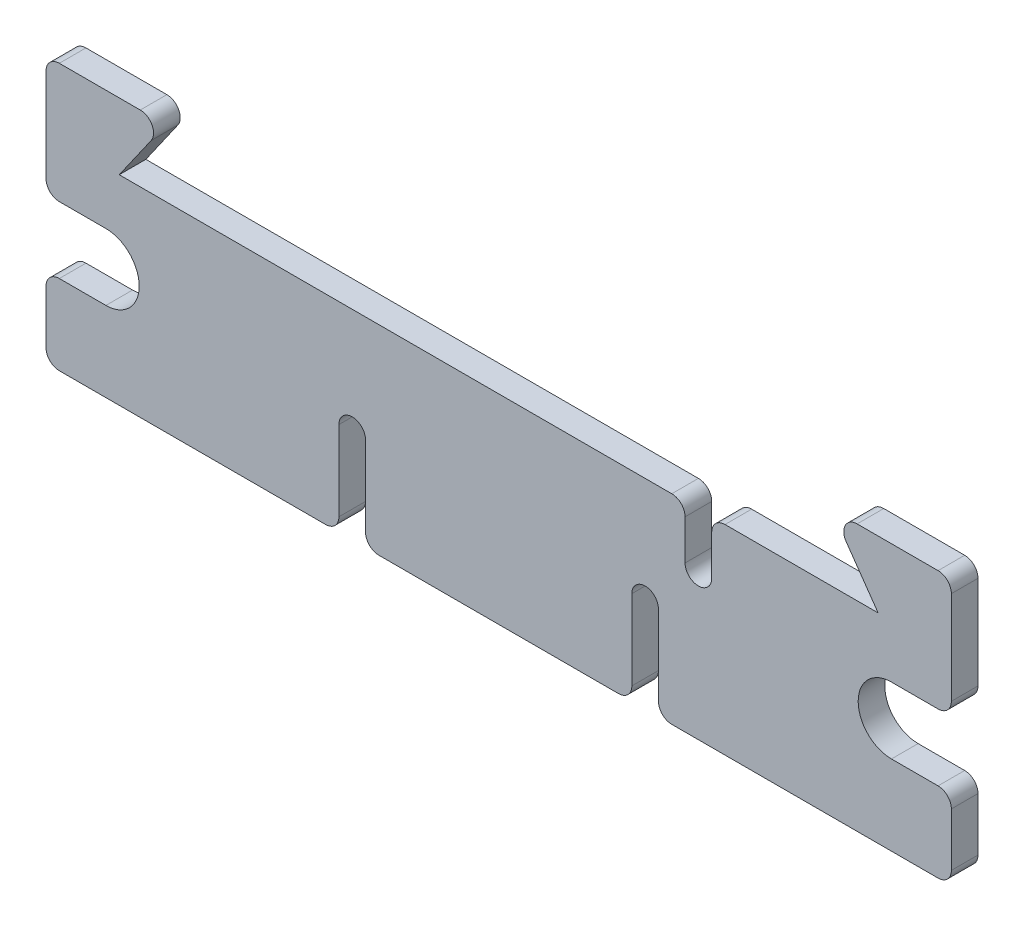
ISO-10303-21;
HEADER;
FILE_DESCRIPTION(('STEP AP214'),'2;1');
FILE_NAME('part.step','',(''),(''),'','','');
FILE_SCHEMA(('AUTOMOTIVE_DESIGN { 1 0 10303 214 1 1 1 1 }'));
ENDSEC;
DATA;
#1=APPLICATION_CONTEXT('core data for automotive mechanical design processes');
#2=APPLICATION_PROTOCOL_DEFINITION('international standard','automotive_design',2000,#1);
#3=PRODUCT_CONTEXT('',#1,'mechanical');
#4=PRODUCT('Part','Part','',(#3));
#5=PRODUCT_RELATED_PRODUCT_CATEGORY('part','',(#4));
#6=PRODUCT_DEFINITION_FORMATION('','',#4);
#7=PRODUCT_DEFINITION_CONTEXT('part definition',#1,'design');
#8=PRODUCT_DEFINITION('design','',#6,#7);
#9=PRODUCT_DEFINITION_SHAPE('','',#8);
#10=(LENGTH_UNIT() NAMED_UNIT(*) SI_UNIT(.MILLI.,.METRE.));
#11=(NAMED_UNIT(*) PLANE_ANGLE_UNIT() SI_UNIT($,.RADIAN.));
#12=(NAMED_UNIT(*) SI_UNIT($,.STERADIAN.) SOLID_ANGLE_UNIT());
#13=UNCERTAINTY_MEASURE_WITH_UNIT(LENGTH_MEASURE(1.E-05),#10,'distance_accuracy_value','');
#14=(GEOMETRIC_REPRESENTATION_CONTEXT(3) GLOBAL_UNCERTAINTY_ASSIGNED_CONTEXT((#13)) GLOBAL_UNIT_ASSIGNED_CONTEXT((#10,
#11,#12)) REPRESENTATION_CONTEXT('',''));
#15=CARTESIAN_POINT('',(0.,0.,0.));
#16=DIRECTION('',(0.,0.,1.));
#17=DIRECTION('',(1.,0.,0.));
#18=AXIS2_PLACEMENT_3D('',#15,#16,#17);
#19=CARTESIAN_POINT('',(17.,0.,2.));
#20=DIRECTION('',(0.,-1.,0.));
#21=DIRECTION('',(1.,0.,0.));
#22=AXIS2_PLACEMENT_3D('',#19,#20,#21);
#23=PLANE('',#22);
#24=DIRECTION('',(-1.,0.,0.));
#25=VECTOR('',#24,1.);
#26=CARTESIAN_POINT('',(17.,0.,0.));
#27=LINE('',#26,#25);
#28=CARTESIAN_POINT('',(28.5,0.,0.));
#29=VERTEX_POINT('',#28);
#30=CARTESIAN_POINT('',(17.,0.,0.));
#31=VERTEX_POINT('',#30);
#32=EDGE_CURVE('E344',#29,#31,#27,.T.);
#33=ORIENTED_EDGE('',*,*,#32,.T.);
#34=DIRECTION('',(0.,0.,-1.));
#35=VECTOR('',#34,1.);
#36=CARTESIAN_POINT('',(17.,0.,2.));
#37=LINE('',#36,#35);
#38=CARTESIAN_POINT('',(17.,0.,2.));
#39=VERTEX_POINT('',#38);
#40=EDGE_CURVE('E11',#39,#31,#37,.T.);
#41=ORIENTED_EDGE('',*,*,#40,.F.);
#42=DIRECTION('',(-1.,0.,0.));
#43=VECTOR('',#42,1.);
#44=CARTESIAN_POINT('',(17.,0.,2.));
#45=LINE('',#44,#43);
#46=CARTESIAN_POINT('',(28.5,0.,2.));
#47=VERTEX_POINT('',#46);
#48=EDGE_CURVE('E430',#47,#39,#45,.T.);
#49=ORIENTED_EDGE('',*,*,#48,.F.);
#50=DIRECTION('',(0.,0.,-1.));
#51=VECTOR('',#50,1.);
#52=CARTESIAN_POINT('',(28.5,0.,2.));
#53=LINE('',#52,#51);
#54=EDGE_CURVE('E340',#47,#29,#53,.T.);
#55=ORIENTED_EDGE('',*,*,#54,.T.);
#56=EDGE_LOOP('',(#33,#41,#49,#55));
#57=FACE_BOUND('',#56,.T.);
#58=ADVANCED_FACE('F32',(#57),#23,.F.);
#59=CARTESIAN_POINT('',(17.,-1.,2.));
#60=DIRECTION('',(0.,0.,-1.));
#61=DIRECTION('',(-1.,0.,0.));
#62=AXIS2_PLACEMENT_3D('',#59,#60,#61);
#63=CYLINDRICAL_SURFACE('',#62,1.);
#64=CARTESIAN_POINT('',(17.,-1.,0.));
#65=DIRECTION('',(0.,0.,1.));
#66=DIRECTION('',(-1.,0.,0.));
#67=AXIS2_PLACEMENT_3D('',#64,#65,#66);
#68=CIRCLE('',#67,1.);
#69=CARTESIAN_POINT('',(16.,-1.00000000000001,0.));
#70=VERTEX_POINT('',#69);
#71=EDGE_CURVE('E347',#31,#70,#68,.T.);
#72=ORIENTED_EDGE('',*,*,#71,.T.);
#73=DIRECTION('',(0.,0.,-1.));
#74=VECTOR('',#73,1.);
#75=CARTESIAN_POINT('',(16.,-1.00000000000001,2.));
#76=LINE('',#75,#74);
#77=CARTESIAN_POINT('',(16.,-1.00000000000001,2.));
#78=VERTEX_POINT('',#77);
#79=EDGE_CURVE('E40',#78,#70,#76,.T.);
#80=ORIENTED_EDGE('',*,*,#79,.F.);
#81=CARTESIAN_POINT('',(17.,-1.,2.));
#82=DIRECTION('',(0.,0.,1.));
#83=DIRECTION('',(-1.,0.,0.));
#84=AXIS2_PLACEMENT_3D('',#81,#82,#83);
#85=CIRCLE('',#84,1.);
#86=EDGE_CURVE('E199',#39,#78,#85,.T.);
#87=ORIENTED_EDGE('',*,*,#86,.F.);
#88=ORIENTED_EDGE('',*,*,#40,.T.);
#89=EDGE_LOOP('',(#72,#80,#87,#88));
#90=FACE_BOUND('',#89,.T.);
#91=ADVANCED_FACE('F668',(#90),#63,.T.);
#92=CARTESIAN_POINT('',(16.,-1.00000000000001,2.));
#93=DIRECTION('',(1.,0.,0.));
#94=DIRECTION('',(0.,0.,-1.));
#95=AXIS2_PLACEMENT_3D('',#92,#93,#94);
#96=PLANE('',#95);
#97=DIRECTION('',(0.,-1.,0.));
#98=VECTOR('',#97,1.);
#99=CARTESIAN_POINT('',(16.,-1.00000000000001,0.));
#100=LINE('',#99,#98);
#101=CARTESIAN_POINT('',(16.,-4.,0.));
#102=VERTEX_POINT('',#101);
#103=EDGE_CURVE('E349',#70,#102,#100,.T.);
#104=ORIENTED_EDGE('',*,*,#103,.T.);
#105=DIRECTION('',(0.,0.,-1.));
#106=VECTOR('',#105,1.);
#107=CARTESIAN_POINT('',(16.,-4.,2.));
#108=LINE('',#107,#106);
#109=CARTESIAN_POINT('',(16.,-4.,2.));
#110=VERTEX_POINT('',#109);
#111=EDGE_CURVE('E545',#110,#102,#108,.T.);
#112=ORIENTED_EDGE('',*,*,#111,.F.);
#113=DIRECTION('',(0.,-1.,0.));
#114=VECTOR('',#113,1.);
#115=CARTESIAN_POINT('',(16.,-1.00000000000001,2.));
#116=LINE('',#115,#114);
#117=EDGE_CURVE('E553',#78,#110,#116,.T.);
#118=ORIENTED_EDGE('',*,*,#117,.F.);
#119=ORIENTED_EDGE('',*,*,#79,.T.);
#120=EDGE_LOOP('',(#104,#112,#118,#119));
#121=FACE_BOUND('',#120,.T.);
#122=ADVANCED_FACE('F551',(#121),#96,.F.);
#123=CARTESIAN_POINT('',(15.,-4.,2.));
#124=DIRECTION('',(0.,0.,-1.));
#125=DIRECTION('',(-1.,0.,0.));
#126=AXIS2_PLACEMENT_3D('',#123,#124,#125);
#127=CYLINDRICAL_SURFACE('',#126,0.999999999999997);
#128=CARTESIAN_POINT('',(15.,-4.,0.));
#129=DIRECTION('',(0.,0.,-1.));
#130=DIRECTION('',(1.,0.,0.));
#131=AXIS2_PLACEMENT_3D('',#128,#129,#130);
#132=CIRCLE('',#131,0.999999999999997);
#133=CARTESIAN_POINT('',(14.,-4.,0.));
#134=VERTEX_POINT('',#133);
#135=EDGE_CURVE('E351',#102,#134,#132,.T.);
#136=ORIENTED_EDGE('',*,*,#135,.T.);
#137=DIRECTION('',(0.,0.,-1.));
#138=VECTOR('',#137,1.);
#139=CARTESIAN_POINT('',(14.,-4.,2.));
#140=LINE('',#139,#138);
#141=CARTESIAN_POINT('',(14.,-4.,2.));
#142=VERTEX_POINT('',#141);
#143=EDGE_CURVE('E542',#142,#134,#140,.T.);
#144=ORIENTED_EDGE('',*,*,#143,.F.);
#145=CARTESIAN_POINT('',(15.,-4.,2.));
#146=DIRECTION('',(0.,0.,-1.));
#147=DIRECTION('',(1.,0.,0.));
#148=AXIS2_PLACEMENT_3D('',#145,#146,#147);
#149=CIRCLE('',#148,0.999999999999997);
#150=EDGE_CURVE('E571',#110,#142,#149,.T.);
#151=ORIENTED_EDGE('',*,*,#150,.F.);
#152=ORIENTED_EDGE('',*,*,#111,.T.);
#153=EDGE_LOOP('',(#136,#144,#151,#152));
#154=FACE_BOUND('',#153,.T.);
#155=ADVANCED_FACE('F562',(#154),#127,.F.);
#156=CARTESIAN_POINT('',(14.,-1.00000000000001,2.));
#157=DIRECTION('',(-1.,0.,0.));
#158=DIRECTION('',(0.,0.,1.));
#159=AXIS2_PLACEMENT_3D('',#156,#157,#158);
#160=PLANE('',#159);
#161=DIRECTION('',(0.,1.,0.));
#162=VECTOR('',#161,1.);
#163=CARTESIAN_POINT('',(14.,-1.00000000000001,0.));
#164=LINE('',#163,#162);
#165=CARTESIAN_POINT('',(14.,-1.00000000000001,0.));
#166=VERTEX_POINT('',#165);
#167=EDGE_CURVE('E353',#134,#166,#164,.T.);
#168=ORIENTED_EDGE('',*,*,#167,.T.);
#169=DIRECTION('',(0.,0.,-1.));
#170=VECTOR('',#169,1.);
#171=CARTESIAN_POINT('',(14.,-1.00000000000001,2.));
#172=LINE('',#171,#170);
#173=CARTESIAN_POINT('',(14.,-1.00000000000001,2.));
#174=VERTEX_POINT('',#173);
#175=EDGE_CURVE('E539',#174,#166,#172,.T.);
#176=ORIENTED_EDGE('',*,*,#175,.F.);
#177=DIRECTION('',(0.,1.,0.));
#178=VECTOR('',#177,1.);
#179=CARTESIAN_POINT('',(14.,-1.00000000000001,2.));
#180=LINE('',#179,#178);
#181=EDGE_CURVE('E568',#142,#174,#180,.T.);
#182=ORIENTED_EDGE('',*,*,#181,.F.);
#183=ORIENTED_EDGE('',*,*,#143,.T.);
#184=EDGE_LOOP('',(#168,#176,#182,#183));
#185=FACE_BOUND('',#184,.T.);
#186=ADVANCED_FACE('F566',(#185),#160,.F.);
#187=CARTESIAN_POINT('',(13.,-1.,2.));
#188=DIRECTION('',(0.,0.,-1.));
#189=DIRECTION('',(-1.,0.,0.));
#190=AXIS2_PLACEMENT_3D('',#187,#188,#189);
#191=CYLINDRICAL_SURFACE('',#190,1.);
#192=CARTESIAN_POINT('',(13.,-1.,0.));
#193=DIRECTION('',(0.,0.,1.));
#194=DIRECTION('',(1.,0.,0.));
#195=AXIS2_PLACEMENT_3D('',#192,#193,#194);
#196=CIRCLE('',#195,1.);
#197=CARTESIAN_POINT('',(13.,0.,0.));
#198=VERTEX_POINT('',#197);
#199=EDGE_CURVE('E355',#166,#198,#196,.T.);
#200=ORIENTED_EDGE('',*,*,#199,.T.);
#201=DIRECTION('',(0.,0.,-1.));
#202=VECTOR('',#201,1.);
#203=CARTESIAN_POINT('',(13.,0.,2.));
#204=LINE('',#203,#202);
#205=CARTESIAN_POINT('',(13.,0.,2.));
#206=VERTEX_POINT('',#205);
#207=EDGE_CURVE('E536',#206,#198,#204,.T.);
#208=ORIENTED_EDGE('',*,*,#207,.F.);
#209=CARTESIAN_POINT('',(13.,-1.,2.));
#210=DIRECTION('',(0.,0.,1.));
#211=DIRECTION('',(1.,0.,0.));
#212=AXIS2_PLACEMENT_3D('',#209,#210,#211);
#213=CIRCLE('',#212,1.);
#214=EDGE_CURVE('E570',#174,#206,#213,.T.);
#215=ORIENTED_EDGE('',*,*,#214,.F.);
#216=ORIENTED_EDGE('',*,*,#175,.T.);
#217=EDGE_LOOP('',(#200,#208,#215,#216));
#218=FACE_BOUND('',#217,.T.);
#219=ADVANCED_FACE('F681',(#218),#191,.T.);
#220=CARTESIAN_POINT('',(-28.5,0.,2.));
#221=DIRECTION('',(0.,-1.,0.));
#222=DIRECTION('',(0.,0.,-1.));
#223=AXIS2_PLACEMENT_3D('',#220,#221,#222);
#224=PLANE('',#223);
#225=DIRECTION('',(-1.,0.,0.));
#226=VECTOR('',#225,1.);
#227=CARTESIAN_POINT('',(-28.5,0.,0.));
#228=LINE('',#227,#226);
#229=CARTESIAN_POINT('',(-28.5,0.,0.));
#230=VERTEX_POINT('',#229);
#231=EDGE_CURVE('E357',#198,#230,#228,.T.);
#232=ORIENTED_EDGE('',*,*,#231,.T.);
#233=DIRECTION('',(0.,0.,-1.));
#234=VECTOR('',#233,1.);
#235=CARTESIAN_POINT('',(-28.5,0.,2.));
#236=LINE('',#235,#234);
#237=CARTESIAN_POINT('',(-28.5,0.,2.));
#238=VERTEX_POINT('',#237);
#239=EDGE_CURVE('E533',#238,#230,#236,.T.);
#240=ORIENTED_EDGE('',*,*,#239,.F.);
#241=DIRECTION('',(-1.,0.,0.));
#242=VECTOR('',#241,1.);
#243=CARTESIAN_POINT('',(-28.5,0.,2.));
#244=LINE('',#243,#242);
#245=EDGE_CURVE('E573',#206,#238,#244,.T.);
#246=ORIENTED_EDGE('',*,*,#245,.F.);
#247=ORIENTED_EDGE('',*,*,#207,.T.);
#248=EDGE_LOOP('',(#232,#240,#246,#247));
#249=FACE_BOUND('',#248,.T.);
#250=ADVANCED_FACE('F684',(#249),#224,.F.);
#251=CARTESIAN_POINT('',(-28.5,0.,2.));
#252=DIRECTION('',(-0.81923192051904,0.573462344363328,0.));
#253=DIRECTION('',(-0.573462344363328,-0.81923192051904,0.));
#254=AXIS2_PLACEMENT_3D('',#251,#252,#253);
#255=PLANE('',#254);
#256=DIRECTION('',(0.573462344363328,0.81923192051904,0.));
#257=VECTOR('',#256,1.);
#258=CARTESIAN_POINT('',(-28.5,0.,0.));
#259=LINE('',#258,#257);
#260=CARTESIAN_POINT('',(-26.1014236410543,3.42653765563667,0.));
#261=VERTEX_POINT('',#260);
#262=EDGE_CURVE('E359',#230,#261,#259,.T.);
#263=ORIENTED_EDGE('',*,*,#262,.T.);
#264=DIRECTION('',(0.,0.,-1.));
#265=VECTOR('',#264,1.);
#266=CARTESIAN_POINT('',(-26.1014236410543,3.42653765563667,2.));
#267=LINE('',#266,#265);
#268=CARTESIAN_POINT('',(-26.1014236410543,3.42653765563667,2.));
#269=VERTEX_POINT('',#268);
#270=EDGE_CURVE('E530',#269,#261,#267,.T.);
#271=ORIENTED_EDGE('',*,*,#270,.F.);
#272=DIRECTION('',(0.573462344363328,0.81923192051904,0.));
#273=VECTOR('',#272,1.);
#274=CARTESIAN_POINT('',(-28.5,0.,2.));
#275=LINE('',#274,#273);
#276=EDGE_CURVE('E579',#238,#269,#275,.T.);
#277=ORIENTED_EDGE('',*,*,#276,.F.);
#278=ORIENTED_EDGE('',*,*,#239,.T.);
#279=EDGE_LOOP('',(#263,#271,#277,#278));
#280=FACE_BOUND('',#279,.T.);
#281=ADVANCED_FACE('F688',(#280),#255,.F.);
#282=CARTESIAN_POINT('',(-26.9206555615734,4.,2.));
#283=DIRECTION('',(0.,0.,-1.));
#284=DIRECTION('',(-1.,0.,0.));
#285=AXIS2_PLACEMENT_3D('',#282,#283,#284);
#286=CYLINDRICAL_SURFACE('',#285,0.999999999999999);
#287=CARTESIAN_POINT('',(-26.9206555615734,4.,0.));
#288=DIRECTION('',(0.,0.,1.));
#289=DIRECTION('',(1.,0.,0.));
#290=AXIS2_PLACEMENT_3D('',#287,#288,#289);
#291=CIRCLE('',#290,0.999999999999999);
#292=CARTESIAN_POINT('',(-26.9206555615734,5.,0.));
#293=VERTEX_POINT('',#292);
#294=EDGE_CURVE('E361',#261,#293,#291,.T.);
#295=ORIENTED_EDGE('',*,*,#294,.T.);
#296=DIRECTION('',(0.,0.,-1.));
#297=VECTOR('',#296,1.);
#298=CARTESIAN_POINT('',(-26.9206555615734,5.,2.));
#299=LINE('',#298,#297);
#300=CARTESIAN_POINT('',(-26.9206555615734,5.,2.));
#301=VERTEX_POINT('',#300);
#302=EDGE_CURVE('E527',#301,#293,#299,.T.);
#303=ORIENTED_EDGE('',*,*,#302,.F.);
#304=CARTESIAN_POINT('',(-26.9206555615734,4.,2.));
#305=DIRECTION('',(0.,0.,1.));
#306=DIRECTION('',(1.,0.,0.));
#307=AXIS2_PLACEMENT_3D('',#304,#305,#306);
#308=CIRCLE('',#307,0.999999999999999);
#309=EDGE_CURVE('E581',#269,#301,#308,.T.);
#310=ORIENTED_EDGE('',*,*,#309,.F.);
#311=ORIENTED_EDGE('',*,*,#270,.T.);
#312=EDGE_LOOP('',(#295,#303,#310,#311));
#313=FACE_BOUND('',#312,.T.);
#314=ADVANCED_FACE('F692',(#313),#286,.T.);
#315=CARTESIAN_POINT('',(-26.9206555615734,5.,2.));
#316=DIRECTION('',(0.,-1.,0.));
#317=DIRECTION('',(0.,0.,-1.));
#318=AXIS2_PLACEMENT_3D('',#315,#316,#317);
#319=PLANE('',#318);
#320=DIRECTION('',(-1.,0.,0.));
#321=VECTOR('',#320,1.);
#322=CARTESIAN_POINT('',(-26.9206555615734,5.,0.));
#323=LINE('',#322,#321);
#324=CARTESIAN_POINT('',(-33.,5.,0.));
#325=VERTEX_POINT('',#324);
#326=EDGE_CURVE('E363',#293,#325,#323,.T.);
#327=ORIENTED_EDGE('',*,*,#326,.T.);
#328=DIRECTION('',(0.,0.,-1.));
#329=VECTOR('',#328,1.);
#330=CARTESIAN_POINT('',(-33.,5.,2.));
#331=LINE('',#330,#329);
#332=CARTESIAN_POINT('',(-33.,5.,2.));
#333=VERTEX_POINT('',#332);
#334=EDGE_CURVE('E524',#333,#325,#331,.T.);
#335=ORIENTED_EDGE('',*,*,#334,.F.);
#336=DIRECTION('',(-1.,0.,0.));
#337=VECTOR('',#336,1.);
#338=CARTESIAN_POINT('',(-26.9206555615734,5.,2.));
#339=LINE('',#338,#337);
#340=EDGE_CURVE('E583',#301,#333,#339,.T.);
#341=ORIENTED_EDGE('',*,*,#340,.F.);
#342=ORIENTED_EDGE('',*,*,#302,.T.);
#343=EDGE_LOOP('',(#327,#335,#341,#342));
#344=FACE_BOUND('',#343,.T.);
#345=ADVANCED_FACE('F696',(#344),#319,.F.);
#346=CARTESIAN_POINT('',(-33.,4.,2.));
#347=DIRECTION('',(0.,0.,-1.));
#348=DIRECTION('',(-1.,0.,0.));
#349=AXIS2_PLACEMENT_3D('',#346,#347,#348);
#350=CYLINDRICAL_SURFACE('',#349,1.);
#351=CARTESIAN_POINT('',(-33.,4.,0.));
#352=DIRECTION('',(0.,0.,1.));
#353=DIRECTION('',(1.,0.,0.));
#354=AXIS2_PLACEMENT_3D('',#351,#352,#353);
#355=CIRCLE('',#354,1.);
#356=CARTESIAN_POINT('',(-34.,3.99999999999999,0.));
#357=VERTEX_POINT('',#356);
#358=EDGE_CURVE('E365',#325,#357,#355,.T.);
#359=ORIENTED_EDGE('',*,*,#358,.T.);
#360=DIRECTION('',(0.,0.,-1.));
#361=VECTOR('',#360,1.);
#362=CARTESIAN_POINT('',(-34.,3.99999999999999,2.));
#363=LINE('',#362,#361);
#364=CARTESIAN_POINT('',(-34.,3.99999999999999,2.));
#365=VERTEX_POINT('',#364);
#366=EDGE_CURVE('E521',#365,#357,#363,.T.);
#367=ORIENTED_EDGE('',*,*,#366,.F.);
#368=CARTESIAN_POINT('',(-33.,4.,2.));
#369=DIRECTION('',(0.,0.,1.));
#370=DIRECTION('',(1.,0.,0.));
#371=AXIS2_PLACEMENT_3D('',#368,#369,#370);
#372=CIRCLE('',#371,1.);
#373=EDGE_CURVE('E585',#333,#365,#372,.T.);
#374=ORIENTED_EDGE('',*,*,#373,.F.);
#375=ORIENTED_EDGE('',*,*,#334,.T.);
#376=EDGE_LOOP('',(#359,#367,#374,#375));
#377=FACE_BOUND('',#376,.T.);
#378=ADVANCED_FACE('F700',(#377),#350,.T.);
#379=CARTESIAN_POINT('',(-34.,3.99999999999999,2.));
#380=DIRECTION('',(1.,0.,0.));
#381=DIRECTION('',(0.,0.,-1.));
#382=AXIS2_PLACEMENT_3D('',#379,#380,#381);
#383=PLANE('',#382);
#384=DIRECTION('',(0.,-1.,0.));
#385=VECTOR('',#384,1.);
#386=CARTESIAN_POINT('',(-34.,3.99999999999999,0.));
#387=LINE('',#386,#385);
#388=CARTESIAN_POINT('',(-34.,-2.99999999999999,0.));
#389=VERTEX_POINT('',#388);
#390=EDGE_CURVE('E367',#357,#389,#387,.T.);
#391=ORIENTED_EDGE('',*,*,#390,.T.);
#392=DIRECTION('',(0.,0.,-1.));
#393=VECTOR('',#392,1.);
#394=CARTESIAN_POINT('',(-34.,-2.99999999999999,2.));
#395=LINE('',#394,#393);
#396=CARTESIAN_POINT('',(-34.,-2.99999999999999,2.));
#397=VERTEX_POINT('',#396);
#398=EDGE_CURVE('E518',#397,#389,#395,.T.);
#399=ORIENTED_EDGE('',*,*,#398,.F.);
#400=DIRECTION('',(0.,-1.,0.));
#401=VECTOR('',#400,1.);
#402=CARTESIAN_POINT('',(-34.,3.99999999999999,2.));
#403=LINE('',#402,#401);
#404=EDGE_CURVE('E587',#365,#397,#403,.T.);
#405=ORIENTED_EDGE('',*,*,#404,.F.);
#406=ORIENTED_EDGE('',*,*,#366,.T.);
#407=EDGE_LOOP('',(#391,#399,#405,#406));
#408=FACE_BOUND('',#407,.T.);
#409=ADVANCED_FACE('F704',(#408),#383,.F.);
#410=CARTESIAN_POINT('',(-33.,-3.,2.));
#411=DIRECTION('',(0.,0.,-1.));
#412=DIRECTION('',(-1.,0.,0.));
#413=AXIS2_PLACEMENT_3D('',#410,#411,#412);
#414=CYLINDRICAL_SURFACE('',#413,1.);
#415=CARTESIAN_POINT('',(-33.,-3.,0.));
#416=DIRECTION('',(0.,0.,1.));
#417=DIRECTION('',(1.,0.,0.));
#418=AXIS2_PLACEMENT_3D('',#415,#416,#417);
#419=CIRCLE('',#418,1.);
#420=CARTESIAN_POINT('',(-33.,-4.,0.));
#421=VERTEX_POINT('',#420);
#422=EDGE_CURVE('E369',#389,#421,#419,.T.);
#423=ORIENTED_EDGE('',*,*,#422,.T.);
#424=DIRECTION('',(0.,0.,-1.));
#425=VECTOR('',#424,1.);
#426=CARTESIAN_POINT('',(-33.,-4.,2.));
#427=LINE('',#426,#425);
#428=CARTESIAN_POINT('',(-33.,-4.,2.));
#429=VERTEX_POINT('',#428);
#430=EDGE_CURVE('E515',#429,#421,#427,.T.);
#431=ORIENTED_EDGE('',*,*,#430,.F.);
#432=CARTESIAN_POINT('',(-33.,-3.,2.));
#433=DIRECTION('',(0.,0.,1.));
#434=DIRECTION('',(1.,0.,0.));
#435=AXIS2_PLACEMENT_3D('',#432,#433,#434);
#436=CIRCLE('',#435,1.);
#437=EDGE_CURVE('E589',#397,#429,#436,.T.);
#438=ORIENTED_EDGE('',*,*,#437,.F.);
#439=ORIENTED_EDGE('',*,*,#398,.T.);
#440=EDGE_LOOP('',(#423,#431,#438,#439));
#441=FACE_BOUND('',#440,.T.);
#442=ADVANCED_FACE('F708',(#441),#414,.T.);
#443=CARTESIAN_POINT('',(-33.,-4.,2.));
#444=DIRECTION('',(0.,1.,0.));
#445=DIRECTION('',(-1.,0.,0.));
#446=AXIS2_PLACEMENT_3D('',#443,#444,#445);
#447=PLANE('',#446);
#448=DIRECTION('',(1.,0.,0.));
#449=VECTOR('',#448,1.);
#450=CARTESIAN_POINT('',(-33.,-4.,0.));
#451=LINE('',#450,#449);
#452=CARTESIAN_POINT('',(-29.5,-4.,0.));
#453=VERTEX_POINT('',#452);
#454=EDGE_CURVE('E371',#421,#453,#451,.T.);
#455=ORIENTED_EDGE('',*,*,#454,.T.);
#456=DIRECTION('',(0.,0.,-1.));
#457=VECTOR('',#456,1.);
#458=CARTESIAN_POINT('',(-29.5,-4.,2.));
#459=LINE('',#458,#457);
#460=CARTESIAN_POINT('',(-29.5,-4.,2.));
#461=VERTEX_POINT('',#460);
#462=EDGE_CURVE('E512',#461,#453,#459,.T.);
#463=ORIENTED_EDGE('',*,*,#462,.F.);
#464=DIRECTION('',(1.,0.,0.));
#465=VECTOR('',#464,1.);
#466=CARTESIAN_POINT('',(-33.,-4.,2.));
#467=LINE('',#466,#465);
#468=EDGE_CURVE('E591',#429,#461,#467,.T.);
#469=ORIENTED_EDGE('',*,*,#468,.F.);
#470=ORIENTED_EDGE('',*,*,#430,.T.);
#471=EDGE_LOOP('',(#455,#463,#469,#470));
#472=FACE_BOUND('',#471,.T.);
#473=ADVANCED_FACE('F712',(#472),#447,.F.);
#474=CARTESIAN_POINT('',(-29.5,-6.5,2.));
#475=DIRECTION('',(0.,0.,-1.));
#476=DIRECTION('',(-1.,0.,0.));
#477=AXIS2_PLACEMENT_3D('',#474,#475,#476);
#478=CYLINDRICAL_SURFACE('',#477,2.5);
#479=CARTESIAN_POINT('',(-29.5,-6.5,0.));
#480=DIRECTION('',(0.,0.,-1.));
#481=DIRECTION('',(-1.,0.,0.));
#482=AXIS2_PLACEMENT_3D('',#479,#480,#481);
#483=CIRCLE('',#482,2.5);
#484=CARTESIAN_POINT('',(-29.5,-9.,0.));
#485=VERTEX_POINT('',#484);
#486=EDGE_CURVE('E373',#453,#485,#483,.T.);
#487=ORIENTED_EDGE('',*,*,#486,.T.);
#488=DIRECTION('',(0.,0.,-1.));
#489=VECTOR('',#488,1.);
#490=CARTESIAN_POINT('',(-29.5,-9.,2.));
#491=LINE('',#490,#489);
#492=CARTESIAN_POINT('',(-29.5,-9.,2.));
#493=VERTEX_POINT('',#492);
#494=EDGE_CURVE('E509',#493,#485,#491,.T.);
#495=ORIENTED_EDGE('',*,*,#494,.F.);
#496=CARTESIAN_POINT('',(-29.5,-6.5,2.));
#497=DIRECTION('',(0.,0.,-1.));
#498=DIRECTION('',(-1.,0.,0.));
#499=AXIS2_PLACEMENT_3D('',#496,#497,#498);
#500=CIRCLE('',#499,2.5);
#501=EDGE_CURVE('E593',#461,#493,#500,.T.);
#502=ORIENTED_EDGE('',*,*,#501,.F.);
#503=ORIENTED_EDGE('',*,*,#462,.T.);
#504=EDGE_LOOP('',(#487,#495,#502,#503));
#505=FACE_BOUND('',#504,.T.);
#506=ADVANCED_FACE('F716',(#505),#478,.F.);
#507=CARTESIAN_POINT('',(-29.5,-9.,2.));
#508=DIRECTION('',(0.,-1.,0.));
#509=DIRECTION('',(1.,0.,0.));
#510=AXIS2_PLACEMENT_3D('',#507,#508,#509);
#511=PLANE('',#510);
#512=DIRECTION('',(-1.,0.,0.));
#513=VECTOR('',#512,1.);
#514=CARTESIAN_POINT('',(-29.5,-9.,0.));
#515=LINE('',#514,#513);
#516=CARTESIAN_POINT('',(-33.,-9.,0.));
#517=VERTEX_POINT('',#516);
#518=EDGE_CURVE('E375',#485,#517,#515,.T.);
#519=ORIENTED_EDGE('',*,*,#518,.T.);
#520=DIRECTION('',(0.,0.,-1.));
#521=VECTOR('',#520,1.);
#522=CARTESIAN_POINT('',(-33.,-9.,2.));
#523=LINE('',#522,#521);
#524=CARTESIAN_POINT('',(-33.,-9.,2.));
#525=VERTEX_POINT('',#524);
#526=EDGE_CURVE('E506',#525,#517,#523,.T.);
#527=ORIENTED_EDGE('',*,*,#526,.F.);
#528=DIRECTION('',(-1.,0.,0.));
#529=VECTOR('',#528,1.);
#530=CARTESIAN_POINT('',(-29.5,-9.,2.));
#531=LINE('',#530,#529);
#532=EDGE_CURVE('E595',#493,#525,#531,.T.);
#533=ORIENTED_EDGE('',*,*,#532,.F.);
#534=ORIENTED_EDGE('',*,*,#494,.T.);
#535=EDGE_LOOP('',(#519,#527,#533,#534));
#536=FACE_BOUND('',#535,.T.);
#537=ADVANCED_FACE('F720',(#536),#511,.F.);
#538=CARTESIAN_POINT('',(-33.,-10.,2.));
#539=DIRECTION('',(0.,0.,-1.));
#540=DIRECTION('',(-1.,0.,0.));
#541=AXIS2_PLACEMENT_3D('',#538,#539,#540);
#542=CYLINDRICAL_SURFACE('',#541,1.);
#543=CARTESIAN_POINT('',(-33.,-10.,0.));
#544=DIRECTION('',(0.,0.,1.));
#545=DIRECTION('',(1.,0.,0.));
#546=AXIS2_PLACEMENT_3D('',#543,#544,#545);
#547=CIRCLE('',#546,1.);
#548=CARTESIAN_POINT('',(-34.,-10.,0.));
#549=VERTEX_POINT('',#548);
#550=EDGE_CURVE('E377',#517,#549,#547,.T.);
#551=ORIENTED_EDGE('',*,*,#550,.T.);
#552=DIRECTION('',(0.,0.,-1.));
#553=VECTOR('',#552,1.);
#554=CARTESIAN_POINT('',(-34.,-10.,2.));
#555=LINE('',#554,#553);
#556=CARTESIAN_POINT('',(-34.,-10.,2.));
#557=VERTEX_POINT('',#556);
#558=EDGE_CURVE('E503',#557,#549,#555,.T.);
#559=ORIENTED_EDGE('',*,*,#558,.F.);
#560=CARTESIAN_POINT('',(-33.,-10.,2.));
#561=DIRECTION('',(0.,0.,1.));
#562=DIRECTION('',(1.,0.,0.));
#563=AXIS2_PLACEMENT_3D('',#560,#561,#562);
#564=CIRCLE('',#563,1.);
#565=EDGE_CURVE('E597',#525,#557,#564,.T.);
#566=ORIENTED_EDGE('',*,*,#565,.F.);
#567=ORIENTED_EDGE('',*,*,#526,.T.);
#568=EDGE_LOOP('',(#551,#559,#566,#567));
#569=FACE_BOUND('',#568,.T.);
#570=ADVANCED_FACE('F724',(#569),#542,.T.);
#571=CARTESIAN_POINT('',(-34.,-10.,2.));
#572=DIRECTION('',(1.,0.,0.));
#573=DIRECTION('',(0.,0.,-1.));
#574=AXIS2_PLACEMENT_3D('',#571,#572,#573);
#575=PLANE('',#574);
#576=DIRECTION('',(0.,-1.,0.));
#577=VECTOR('',#576,1.);
#578=CARTESIAN_POINT('',(-34.,-10.,0.));
#579=LINE('',#578,#577);
#580=CARTESIAN_POINT('',(-34.,-14.,0.));
#581=VERTEX_POINT('',#580);
#582=EDGE_CURVE('E379',#549,#581,#579,.T.);
#583=ORIENTED_EDGE('',*,*,#582,.T.);
#584=DIRECTION('',(0.,0.,-1.));
#585=VECTOR('',#584,1.);
#586=CARTESIAN_POINT('',(-34.,-14.,2.));
#587=LINE('',#586,#585);
#588=CARTESIAN_POINT('',(-34.,-14.,2.));
#589=VERTEX_POINT('',#588);
#590=EDGE_CURVE('E500',#589,#581,#587,.T.);
#591=ORIENTED_EDGE('',*,*,#590,.F.);
#592=DIRECTION('',(0.,-1.,0.));
#593=VECTOR('',#592,1.);
#594=CARTESIAN_POINT('',(-34.,-10.,2.));
#595=LINE('',#594,#593);
#596=EDGE_CURVE('E599',#557,#589,#595,.T.);
#597=ORIENTED_EDGE('',*,*,#596,.F.);
#598=ORIENTED_EDGE('',*,*,#558,.T.);
#599=EDGE_LOOP('',(#583,#591,#597,#598));
#600=FACE_BOUND('',#599,.T.);
#601=ADVANCED_FACE('F728',(#600),#575,.F.);
#602=CARTESIAN_POINT('',(-33.,-14.,2.));
#603=DIRECTION('',(0.,0.,-1.));
#604=DIRECTION('',(-1.,0.,0.));
#605=AXIS2_PLACEMENT_3D('',#602,#603,#604);
#606=CYLINDRICAL_SURFACE('',#605,1.);
#607=CARTESIAN_POINT('',(-33.,-14.,0.));
#608=DIRECTION('',(0.,0.,1.));
#609=DIRECTION('',(1.,0.,0.));
#610=AXIS2_PLACEMENT_3D('',#607,#608,#609);
#611=CIRCLE('',#610,1.);
#612=CARTESIAN_POINT('',(-33.,-15.,0.));
#613=VERTEX_POINT('',#612);
#614=EDGE_CURVE('E381',#581,#613,#611,.T.);
#615=ORIENTED_EDGE('',*,*,#614,.T.);
#616=DIRECTION('',(0.,0.,-1.));
#617=VECTOR('',#616,1.);
#618=CARTESIAN_POINT('',(-33.,-15.,2.));
#619=LINE('',#618,#617);
#620=CARTESIAN_POINT('',(-33.,-15.,2.));
#621=VERTEX_POINT('',#620);
#622=EDGE_CURVE('E497',#621,#613,#619,.T.);
#623=ORIENTED_EDGE('',*,*,#622,.F.);
#624=CARTESIAN_POINT('',(-33.,-14.,2.));
#625=DIRECTION('',(0.,0.,1.));
#626=DIRECTION('',(1.,0.,0.));
#627=AXIS2_PLACEMENT_3D('',#624,#625,#626);
#628=CIRCLE('',#627,1.);
#629=EDGE_CURVE('E601',#589,#621,#628,.T.);
#630=ORIENTED_EDGE('',*,*,#629,.F.);
#631=ORIENTED_EDGE('',*,*,#590,.T.);
#632=EDGE_LOOP('',(#615,#623,#630,#631));
#633=FACE_BOUND('',#632,.T.);
#634=ADVANCED_FACE('F732',(#633),#606,.T.);
#635=CARTESIAN_POINT('',(-33.,-15.,2.));
#636=DIRECTION('',(0.,1.,0.));
#637=DIRECTION('',(-1.,0.,0.));
#638=AXIS2_PLACEMENT_3D('',#635,#636,#637);
#639=PLANE('',#638);
#640=DIRECTION('',(1.,0.,0.));
#641=VECTOR('',#640,1.);
#642=CARTESIAN_POINT('',(-33.,-15.,0.));
#643=LINE('',#642,#641);
#644=CARTESIAN_POINT('',(-13.,-15.,0.));
#645=VERTEX_POINT('',#644);
#646=EDGE_CURVE('E383',#613,#645,#643,.T.);
#647=ORIENTED_EDGE('',*,*,#646,.T.);
#648=DIRECTION('',(0.,0.,-1.));
#649=VECTOR('',#648,1.);
#650=CARTESIAN_POINT('',(-13.,-15.,2.));
#651=LINE('',#650,#649);
#652=CARTESIAN_POINT('',(-13.,-15.,2.));
#653=VERTEX_POINT('',#652);
#654=EDGE_CURVE('E494',#653,#645,#651,.T.);
#655=ORIENTED_EDGE('',*,*,#654,.F.);
#656=DIRECTION('',(1.,0.,0.));
#657=VECTOR('',#656,1.);
#658=CARTESIAN_POINT('',(-33.,-15.,2.));
#659=LINE('',#658,#657);
#660=EDGE_CURVE('E603',#621,#653,#659,.T.);
#661=ORIENTED_EDGE('',*,*,#660,.F.);
#662=ORIENTED_EDGE('',*,*,#622,.T.);
#663=EDGE_LOOP('',(#647,#655,#661,#662));
#664=FACE_BOUND('',#663,.T.);
#665=ADVANCED_FACE('F736',(#664),#639,.F.);
#666=CARTESIAN_POINT('',(-13.,-14.,2.));
#667=DIRECTION('',(0.,0.,-1.));
#668=DIRECTION('',(-1.,0.,0.));
#669=AXIS2_PLACEMENT_3D('',#666,#667,#668);
#670=CYLINDRICAL_SURFACE('',#669,1.);
#671=CARTESIAN_POINT('',(-13.,-14.,0.));
#672=DIRECTION('',(0.,0.,1.));
#673=DIRECTION('',(-1.,0.,0.));
#674=AXIS2_PLACEMENT_3D('',#671,#672,#673);
#675=CIRCLE('',#674,1.);
#676=CARTESIAN_POINT('',(-12.,-14.,0.));
#677=VERTEX_POINT('',#676);
#678=EDGE_CURVE('E385',#645,#677,#675,.T.);
#679=ORIENTED_EDGE('',*,*,#678,.T.);
#680=DIRECTION('',(0.,0.,-1.));
#681=VECTOR('',#680,1.);
#682=CARTESIAN_POINT('',(-12.,-14.,2.));
#683=LINE('',#682,#681);
#684=CARTESIAN_POINT('',(-12.,-14.,2.));
#685=VERTEX_POINT('',#684);
#686=EDGE_CURVE('E491',#685,#677,#683,.T.);
#687=ORIENTED_EDGE('',*,*,#686,.F.);
#688=CARTESIAN_POINT('',(-13.,-14.,2.));
#689=DIRECTION('',(0.,0.,1.));
#690=DIRECTION('',(-1.,0.,0.));
#691=AXIS2_PLACEMENT_3D('',#688,#689,#690);
#692=CIRCLE('',#691,1.);
#693=EDGE_CURVE('E605',#653,#685,#692,.T.);
#694=ORIENTED_EDGE('',*,*,#693,.F.);
#695=ORIENTED_EDGE('',*,*,#654,.T.);
#696=EDGE_LOOP('',(#679,#687,#694,#695));
#697=FACE_BOUND('',#696,.T.);
#698=ADVANCED_FACE('F740',(#697),#670,.T.);
#699=CARTESIAN_POINT('',(-12.,-14.,2.));
#700=DIRECTION('',(-1.,0.,0.));
#701=DIRECTION('',(0.,0.,1.));
#702=AXIS2_PLACEMENT_3D('',#699,#700,#701);
#703=PLANE('',#702);
#704=DIRECTION('',(0.,1.,0.));
#705=VECTOR('',#704,1.);
#706=CARTESIAN_POINT('',(-12.,-14.,0.));
#707=LINE('',#706,#705);
#708=CARTESIAN_POINT('',(-12.,-8.,0.));
#709=VERTEX_POINT('',#708);
#710=EDGE_CURVE('E387',#677,#709,#707,.T.);
#711=ORIENTED_EDGE('',*,*,#710,.T.);
#712=DIRECTION('',(0.,0.,-1.));
#713=VECTOR('',#712,1.);
#714=CARTESIAN_POINT('',(-12.,-8.,2.));
#715=LINE('',#714,#713);
#716=CARTESIAN_POINT('',(-12.,-8.,2.));
#717=VERTEX_POINT('',#716);
#718=EDGE_CURVE('E488',#717,#709,#715,.T.);
#719=ORIENTED_EDGE('',*,*,#718,.F.);
#720=DIRECTION('',(0.,1.,0.));
#721=VECTOR('',#720,1.);
#722=CARTESIAN_POINT('',(-12.,-14.,2.));
#723=LINE('',#722,#721);
#724=EDGE_CURVE('E607',#685,#717,#723,.T.);
#725=ORIENTED_EDGE('',*,*,#724,.F.);
#726=ORIENTED_EDGE('',*,*,#686,.T.);
#727=EDGE_LOOP('',(#711,#719,#725,#726));
#728=FACE_BOUND('',#727,.T.);
#729=ADVANCED_FACE('F744',(#728),#703,.F.);
#730=CARTESIAN_POINT('',(-11.,-8.,2.));
#731=DIRECTION('',(0.,0.,-1.));
#732=DIRECTION('',(-1.,0.,0.));
#733=AXIS2_PLACEMENT_3D('',#730,#731,#732);
#734=CYLINDRICAL_SURFACE('',#733,1.);
#735=CARTESIAN_POINT('',(-11.,-8.,0.));
#736=DIRECTION('',(0.,0.,-1.));
#737=DIRECTION('',(-1.,0.,0.));
#738=AXIS2_PLACEMENT_3D('',#735,#736,#737);
#739=CIRCLE('',#738,1.);
#740=CARTESIAN_POINT('',(-10.,-8.,0.));
#741=VERTEX_POINT('',#740);
#742=EDGE_CURVE('E389',#709,#741,#739,.T.);
#743=ORIENTED_EDGE('',*,*,#742,.T.);
#744=DIRECTION('',(0.,0.,-1.));
#745=VECTOR('',#744,1.);
#746=CARTESIAN_POINT('',(-10.,-8.,2.));
#747=LINE('',#746,#745);
#748=CARTESIAN_POINT('',(-10.,-8.,2.));
#749=VERTEX_POINT('',#748);
#750=EDGE_CURVE('E485',#749,#741,#747,.T.);
#751=ORIENTED_EDGE('',*,*,#750,.F.);
#752=CARTESIAN_POINT('',(-11.,-8.,2.));
#753=DIRECTION('',(0.,0.,-1.));
#754=DIRECTION('',(-1.,0.,0.));
#755=AXIS2_PLACEMENT_3D('',#752,#753,#754);
#756=CIRCLE('',#755,1.);
#757=EDGE_CURVE('E609',#717,#749,#756,.T.);
#758=ORIENTED_EDGE('',*,*,#757,.F.);
#759=ORIENTED_EDGE('',*,*,#718,.T.);
#760=EDGE_LOOP('',(#743,#751,#758,#759));
#761=FACE_BOUND('',#760,.T.);
#762=ADVANCED_FACE('F748',(#761),#734,.F.);
#763=CARTESIAN_POINT('',(-10.,-14.,2.));
#764=DIRECTION('',(1.,0.,0.));
#765=DIRECTION('',(0.,1.,0.));
#766=AXIS2_PLACEMENT_3D('',#763,#764,#765);
#767=PLANE('',#766);
#768=DIRECTION('',(0.,-1.,0.));
#769=VECTOR('',#768,1.);
#770=CARTESIAN_POINT('',(-10.,-14.,0.));
#771=LINE('',#770,#769);
#772=CARTESIAN_POINT('',(-10.,-14.,0.));
#773=VERTEX_POINT('',#772);
#774=EDGE_CURVE('E391',#741,#773,#771,.T.);
#775=ORIENTED_EDGE('',*,*,#774,.T.);
#776=DIRECTION('',(0.,0.,-1.));
#777=VECTOR('',#776,1.);
#778=CARTESIAN_POINT('',(-10.,-14.,2.));
#779=LINE('',#778,#777);
#780=CARTESIAN_POINT('',(-10.,-14.,2.));
#781=VERTEX_POINT('',#780);
#782=EDGE_CURVE('E482',#781,#773,#779,.T.);
#783=ORIENTED_EDGE('',*,*,#782,.F.);
#784=DIRECTION('',(0.,-1.,0.));
#785=VECTOR('',#784,1.);
#786=CARTESIAN_POINT('',(-10.,-14.,2.));
#787=LINE('',#786,#785);
#788=EDGE_CURVE('E611',#749,#781,#787,.T.);
#789=ORIENTED_EDGE('',*,*,#788,.F.);
#790=ORIENTED_EDGE('',*,*,#750,.T.);
#791=EDGE_LOOP('',(#775,#783,#789,#790));
#792=FACE_BOUND('',#791,.T.);
#793=ADVANCED_FACE('F752',(#792),#767,.F.);
#794=CARTESIAN_POINT('',(-9.,-14.,2.));
#795=DIRECTION('',(0.,0.,-1.));
#796=DIRECTION('',(-1.,0.,0.));
#797=AXIS2_PLACEMENT_3D('',#794,#795,#796);
#798=CYLINDRICAL_SURFACE('',#797,1.);
#799=CARTESIAN_POINT('',(-9.,-14.,0.));
#800=DIRECTION('',(0.,0.,1.));
#801=DIRECTION('',(1.,0.,0.));
#802=AXIS2_PLACEMENT_3D('',#799,#800,#801);
#803=CIRCLE('',#802,1.);
#804=CARTESIAN_POINT('',(-8.99999999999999,-15.,0.));
#805=VERTEX_POINT('',#804);
#806=EDGE_CURVE('E393',#773,#805,#803,.T.);
#807=ORIENTED_EDGE('',*,*,#806,.T.);
#808=DIRECTION('',(0.,0.,-1.));
#809=VECTOR('',#808,1.);
#810=CARTESIAN_POINT('',(-8.99999999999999,-15.,2.));
#811=LINE('',#810,#809);
#812=CARTESIAN_POINT('',(-8.99999999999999,-15.,2.));
#813=VERTEX_POINT('',#812);
#814=EDGE_CURVE('E479',#813,#805,#811,.T.);
#815=ORIENTED_EDGE('',*,*,#814,.F.);
#816=CARTESIAN_POINT('',(-9.,-14.,2.));
#817=DIRECTION('',(0.,0.,1.));
#818=DIRECTION('',(1.,0.,0.));
#819=AXIS2_PLACEMENT_3D('',#816,#817,#818);
#820=CIRCLE('',#819,1.);
#821=EDGE_CURVE('E613',#781,#813,#820,.T.);
#822=ORIENTED_EDGE('',*,*,#821,.F.);
#823=ORIENTED_EDGE('',*,*,#782,.T.);
#824=EDGE_LOOP('',(#807,#815,#822,#823));
#825=FACE_BOUND('',#824,.T.);
#826=ADVANCED_FACE('F756',(#825),#798,.T.);
#827=CARTESIAN_POINT('',(8.99999999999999,-15.,2.));
#828=DIRECTION('',(0.,1.,0.));
#829=DIRECTION('',(0.,0.,1.));
#830=AXIS2_PLACEMENT_3D('',#827,#828,#829);
#831=PLANE('',#830);
#832=DIRECTION('',(1.,0.,0.));
#833=VECTOR('',#832,1.);
#834=CARTESIAN_POINT('',(8.99999999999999,-15.,0.));
#835=LINE('',#834,#833);
#836=CARTESIAN_POINT('',(8.99999999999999,-15.,0.));
#837=VERTEX_POINT('',#836);
#838=EDGE_CURVE('E395',#805,#837,#835,.T.);
#839=ORIENTED_EDGE('',*,*,#838,.T.);
#840=DIRECTION('',(0.,0.,-1.));
#841=VECTOR('',#840,1.);
#842=CARTESIAN_POINT('',(8.99999999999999,-15.,2.));
#843=LINE('',#842,#841);
#844=CARTESIAN_POINT('',(8.99999999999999,-15.,2.));
#845=VERTEX_POINT('',#844);
#846=EDGE_CURVE('E476',#845,#837,#843,.T.);
#847=ORIENTED_EDGE('',*,*,#846,.F.);
#848=DIRECTION('',(1.,0.,0.));
#849=VECTOR('',#848,1.);
#850=CARTESIAN_POINT('',(8.99999999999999,-15.,2.));
#851=LINE('',#850,#849);
#852=EDGE_CURVE('E615',#813,#845,#851,.T.);
#853=ORIENTED_EDGE('',*,*,#852,.F.);
#854=ORIENTED_EDGE('',*,*,#814,.T.);
#855=EDGE_LOOP('',(#839,#847,#853,#854));
#856=FACE_BOUND('',#855,.T.);
#857=ADVANCED_FACE('F760',(#856),#831,.F.);
#858=CARTESIAN_POINT('',(9.,-14.,2.));
#859=DIRECTION('',(0.,0.,-1.));
#860=DIRECTION('',(-1.,0.,0.));
#861=AXIS2_PLACEMENT_3D('',#858,#859,#860);
#862=CYLINDRICAL_SURFACE('',#861,1.);
#863=CARTESIAN_POINT('',(9.,-14.,0.));
#864=DIRECTION('',(0.,0.,1.));
#865=DIRECTION('',(-1.,0.,0.));
#866=AXIS2_PLACEMENT_3D('',#863,#864,#865);
#867=CIRCLE('',#866,1.);
#868=CARTESIAN_POINT('',(10.,-14.,0.));
#869=VERTEX_POINT('',#868);
#870=EDGE_CURVE('E397',#837,#869,#867,.T.);
#871=ORIENTED_EDGE('',*,*,#870,.T.);
#872=DIRECTION('',(0.,0.,-1.));
#873=VECTOR('',#872,1.);
#874=CARTESIAN_POINT('',(10.,-14.,2.));
#875=LINE('',#874,#873);
#876=CARTESIAN_POINT('',(10.,-14.,2.));
#877=VERTEX_POINT('',#876);
#878=EDGE_CURVE('E473',#877,#869,#875,.T.);
#879=ORIENTED_EDGE('',*,*,#878,.F.);
#880=CARTESIAN_POINT('',(9.,-14.,2.));
#881=DIRECTION('',(0.,0.,1.));
#882=DIRECTION('',(-1.,0.,0.));
#883=AXIS2_PLACEMENT_3D('',#880,#881,#882);
#884=CIRCLE('',#883,1.);
#885=EDGE_CURVE('E617',#845,#877,#884,.T.);
#886=ORIENTED_EDGE('',*,*,#885,.F.);
#887=ORIENTED_EDGE('',*,*,#846,.T.);
#888=EDGE_LOOP('',(#871,#879,#886,#887));
#889=FACE_BOUND('',#888,.T.);
#890=ADVANCED_FACE('F764',(#889),#862,.T.);
#891=CARTESIAN_POINT('',(10.,-14.,2.));
#892=DIRECTION('',(-1.,0.,0.));
#893=DIRECTION('',(0.,-1.,0.));
#894=AXIS2_PLACEMENT_3D('',#891,#892,#893);
#895=PLANE('',#894);
#896=DIRECTION('',(0.,1.,0.));
#897=VECTOR('',#896,1.);
#898=CARTESIAN_POINT('',(10.,-14.,0.));
#899=LINE('',#898,#897);
#900=CARTESIAN_POINT('',(10.,-8.,0.));
#901=VERTEX_POINT('',#900);
#902=EDGE_CURVE('E399',#869,#901,#899,.T.);
#903=ORIENTED_EDGE('',*,*,#902,.T.);
#904=DIRECTION('',(0.,0.,-1.));
#905=VECTOR('',#904,1.);
#906=CARTESIAN_POINT('',(10.,-8.,2.));
#907=LINE('',#906,#905);
#908=CARTESIAN_POINT('',(10.,-8.,2.));
#909=VERTEX_POINT('',#908);
#910=EDGE_CURVE('E470',#909,#901,#907,.T.);
#911=ORIENTED_EDGE('',*,*,#910,.F.);
#912=DIRECTION('',(0.,1.,0.));
#913=VECTOR('',#912,1.);
#914=CARTESIAN_POINT('',(10.,-14.,2.));
#915=LINE('',#914,#913);
#916=EDGE_CURVE('E619',#877,#909,#915,.T.);
#917=ORIENTED_EDGE('',*,*,#916,.F.);
#918=ORIENTED_EDGE('',*,*,#878,.T.);
#919=EDGE_LOOP('',(#903,#911,#917,#918));
#920=FACE_BOUND('',#919,.T.);
#921=ADVANCED_FACE('F768',(#920),#895,.F.);
#922=CARTESIAN_POINT('',(11.,-8.,2.));
#923=DIRECTION('',(0.,0.,-1.));
#924=DIRECTION('',(-1.,0.,0.));
#925=AXIS2_PLACEMENT_3D('',#922,#923,#924);
#926=CYLINDRICAL_SURFACE('',#925,1.);
#927=CARTESIAN_POINT('',(11.,-8.,0.));
#928=DIRECTION('',(0.,0.,-1.));
#929=DIRECTION('',(1.,0.,0.));
#930=AXIS2_PLACEMENT_3D('',#927,#928,#929);
#931=CIRCLE('',#930,1.);
#932=CARTESIAN_POINT('',(12.,-8.,0.));
#933=VERTEX_POINT('',#932);
#934=EDGE_CURVE('E401',#901,#933,#931,.T.);
#935=ORIENTED_EDGE('',*,*,#934,.T.);
#936=DIRECTION('',(0.,0.,-1.));
#937=VECTOR('',#936,1.);
#938=CARTESIAN_POINT('',(12.,-8.,2.));
#939=LINE('',#938,#937);
#940=CARTESIAN_POINT('',(12.,-8.,2.));
#941=VERTEX_POINT('',#940);
#942=EDGE_CURVE('E467',#941,#933,#939,.T.);
#943=ORIENTED_EDGE('',*,*,#942,.F.);
#944=CARTESIAN_POINT('',(11.,-8.,2.));
#945=DIRECTION('',(0.,0.,-1.));
#946=DIRECTION('',(1.,0.,0.));
#947=AXIS2_PLACEMENT_3D('',#944,#945,#946);
#948=CIRCLE('',#947,1.);
#949=EDGE_CURVE('E621',#909,#941,#948,.T.);
#950=ORIENTED_EDGE('',*,*,#949,.F.);
#951=ORIENTED_EDGE('',*,*,#910,.T.);
#952=EDGE_LOOP('',(#935,#943,#950,#951));
#953=FACE_BOUND('',#952,.T.);
#954=ADVANCED_FACE('F772',(#953),#926,.F.);
#955=CARTESIAN_POINT('',(12.,-14.,2.));
#956=DIRECTION('',(1.,0.,0.));
#957=DIRECTION('',(0.,0.,-1.));
#958=AXIS2_PLACEMENT_3D('',#955,#956,#957);
#959=PLANE('',#958);
#960=DIRECTION('',(0.,-1.,0.));
#961=VECTOR('',#960,1.);
#962=CARTESIAN_POINT('',(12.,-14.,0.));
#963=LINE('',#962,#961);
#964=CARTESIAN_POINT('',(12.,-14.,0.));
#965=VERTEX_POINT('',#964);
#966=EDGE_CURVE('E403',#933,#965,#963,.T.);
#967=ORIENTED_EDGE('',*,*,#966,.T.);
#968=DIRECTION('',(0.,0.,-1.));
#969=VECTOR('',#968,1.);
#970=CARTESIAN_POINT('',(12.,-14.,2.));
#971=LINE('',#970,#969);
#972=CARTESIAN_POINT('',(12.,-14.,2.));
#973=VERTEX_POINT('',#972);
#974=EDGE_CURVE('E464',#973,#965,#971,.T.);
#975=ORIENTED_EDGE('',*,*,#974,.F.);
#976=DIRECTION('',(0.,-1.,0.));
#977=VECTOR('',#976,1.);
#978=CARTESIAN_POINT('',(12.,-14.,2.));
#979=LINE('',#978,#977);
#980=EDGE_CURVE('E623',#941,#973,#979,.T.);
#981=ORIENTED_EDGE('',*,*,#980,.F.);
#982=ORIENTED_EDGE('',*,*,#942,.T.);
#983=EDGE_LOOP('',(#967,#975,#981,#982));
#984=FACE_BOUND('',#983,.T.);
#985=ADVANCED_FACE('F776',(#984),#959,.F.);
#986=CARTESIAN_POINT('',(13.,-14.,2.));
#987=DIRECTION('',(0.,0.,-1.));
#988=DIRECTION('',(-1.,0.,0.));
#989=AXIS2_PLACEMENT_3D('',#986,#987,#988);
#990=CYLINDRICAL_SURFACE('',#989,1.);
#991=CARTESIAN_POINT('',(13.,-14.,0.));
#992=DIRECTION('',(0.,0.,1.));
#993=DIRECTION('',(1.,0.,0.));
#994=AXIS2_PLACEMENT_3D('',#991,#992,#993);
#995=CIRCLE('',#994,1.);
#996=CARTESIAN_POINT('',(13.,-15.,0.));
#997=VERTEX_POINT('',#996);
#998=EDGE_CURVE('E405',#965,#997,#995,.T.);
#999=ORIENTED_EDGE('',*,*,#998,.T.);
#1000=DIRECTION('',(0.,0.,-1.));
#1001=VECTOR('',#1000,1.);
#1002=CARTESIAN_POINT('',(13.,-15.,2.));
#1003=LINE('',#1002,#1001);
#1004=CARTESIAN_POINT('',(13.,-15.,2.));
#1005=VERTEX_POINT('',#1004);
#1006=EDGE_CURVE('E461',#1005,#997,#1003,.T.);
#1007=ORIENTED_EDGE('',*,*,#1006,.F.);
#1008=CARTESIAN_POINT('',(13.,-14.,2.));
#1009=DIRECTION('',(0.,0.,1.));
#1010=DIRECTION('',(1.,0.,0.));
#1011=AXIS2_PLACEMENT_3D('',#1008,#1009,#1010);
#1012=CIRCLE('',#1011,1.);
#1013=EDGE_CURVE('E625',#973,#1005,#1012,.T.);
#1014=ORIENTED_EDGE('',*,*,#1013,.F.);
#1015=ORIENTED_EDGE('',*,*,#974,.T.);
#1016=EDGE_LOOP('',(#999,#1007,#1014,#1015));
#1017=FACE_BOUND('',#1016,.T.);
#1018=ADVANCED_FACE('F780',(#1017),#990,.T.);
#1019=CARTESIAN_POINT('',(33.,-15.,2.));
#1020=DIRECTION('',(0.,1.,0.));
#1021=DIRECTION('',(-1.,0.,0.));
#1022=AXIS2_PLACEMENT_3D('',#1019,#1020,#1021);
#1023=PLANE('',#1022);
#1024=DIRECTION('',(1.,0.,0.));
#1025=VECTOR('',#1024,1.);
#1026=CARTESIAN_POINT('',(33.,-15.,0.));
#1027=LINE('',#1026,#1025);
#1028=CARTESIAN_POINT('',(33.,-15.,0.));
#1029=VERTEX_POINT('',#1028);
#1030=EDGE_CURVE('E407',#997,#1029,#1027,.T.);
#1031=ORIENTED_EDGE('',*,*,#1030,.T.);
#1032=DIRECTION('',(0.,0.,-1.));
#1033=VECTOR('',#1032,1.);
#1034=CARTESIAN_POINT('',(33.,-15.,2.));
#1035=LINE('',#1034,#1033);
#1036=CARTESIAN_POINT('',(33.,-15.,2.));
#1037=VERTEX_POINT('',#1036);
#1038=EDGE_CURVE('E458',#1037,#1029,#1035,.T.);
#1039=ORIENTED_EDGE('',*,*,#1038,.F.);
#1040=DIRECTION('',(1.,0.,0.));
#1041=VECTOR('',#1040,1.);
#1042=CARTESIAN_POINT('',(33.,-15.,2.));
#1043=LINE('',#1042,#1041);
#1044=EDGE_CURVE('E627',#1005,#1037,#1043,.T.);
#1045=ORIENTED_EDGE('',*,*,#1044,.F.);
#1046=ORIENTED_EDGE('',*,*,#1006,.T.);
#1047=EDGE_LOOP('',(#1031,#1039,#1045,#1046));
#1048=FACE_BOUND('',#1047,.T.);
#1049=ADVANCED_FACE('F784',(#1048),#1023,.F.);
#1050=CARTESIAN_POINT('',(33.,-14.,2.));
#1051=DIRECTION('',(0.,0.,-1.));
#1052=DIRECTION('',(-1.,0.,0.));
#1053=AXIS2_PLACEMENT_3D('',#1050,#1051,#1052);
#1054=CYLINDRICAL_SURFACE('',#1053,1.);
#1055=CARTESIAN_POINT('',(33.,-14.,0.));
#1056=DIRECTION('',(0.,0.,1.));
#1057=DIRECTION('',(-1.,0.,0.));
#1058=AXIS2_PLACEMENT_3D('',#1055,#1056,#1057);
#1059=CIRCLE('',#1058,1.);
#1060=CARTESIAN_POINT('',(34.,-14.,0.));
#1061=VERTEX_POINT('',#1060);
#1062=EDGE_CURVE('E409',#1029,#1061,#1059,.T.);
#1063=ORIENTED_EDGE('',*,*,#1062,.T.);
#1064=DIRECTION('',(0.,0.,-1.));
#1065=VECTOR('',#1064,1.);
#1066=CARTESIAN_POINT('',(34.,-14.,2.));
#1067=LINE('',#1066,#1065);
#1068=CARTESIAN_POINT('',(34.,-14.,2.));
#1069=VERTEX_POINT('',#1068);
#1070=EDGE_CURVE('E455',#1069,#1061,#1067,.T.);
#1071=ORIENTED_EDGE('',*,*,#1070,.F.);
#1072=CARTESIAN_POINT('',(33.,-14.,2.));
#1073=DIRECTION('',(0.,0.,1.));
#1074=DIRECTION('',(-1.,0.,0.));
#1075=AXIS2_PLACEMENT_3D('',#1072,#1073,#1074);
#1076=CIRCLE('',#1075,1.);
#1077=EDGE_CURVE('E629',#1037,#1069,#1076,.T.);
#1078=ORIENTED_EDGE('',*,*,#1077,.F.);
#1079=ORIENTED_EDGE('',*,*,#1038,.T.);
#1080=EDGE_LOOP('',(#1063,#1071,#1078,#1079));
#1081=FACE_BOUND('',#1080,.T.);
#1082=ADVANCED_FACE('F788',(#1081),#1054,.T.);
#1083=CARTESIAN_POINT('',(34.,-10.,2.));
#1084=DIRECTION('',(-1.,0.,0.));
#1085=DIRECTION('',(0.,0.,1.));
#1086=AXIS2_PLACEMENT_3D('',#1083,#1084,#1085);
#1087=PLANE('',#1086);
#1088=DIRECTION('',(0.,1.,0.));
#1089=VECTOR('',#1088,1.);
#1090=CARTESIAN_POINT('',(34.,-10.,0.));
#1091=LINE('',#1090,#1089);
#1092=CARTESIAN_POINT('',(34.,-10.,0.));
#1093=VERTEX_POINT('',#1092);
#1094=EDGE_CURVE('E411',#1061,#1093,#1091,.T.);
#1095=ORIENTED_EDGE('',*,*,#1094,.T.);
#1096=DIRECTION('',(0.,0.,-1.));
#1097=VECTOR('',#1096,1.);
#1098=CARTESIAN_POINT('',(34.,-10.,2.));
#1099=LINE('',#1098,#1097);
#1100=CARTESIAN_POINT('',(34.,-10.,2.));
#1101=VERTEX_POINT('',#1100);
#1102=EDGE_CURVE('E452',#1101,#1093,#1099,.T.);
#1103=ORIENTED_EDGE('',*,*,#1102,.F.);
#1104=DIRECTION('',(0.,1.,0.));
#1105=VECTOR('',#1104,1.);
#1106=CARTESIAN_POINT('',(34.,-10.,2.));
#1107=LINE('',#1106,#1105);
#1108=EDGE_CURVE('E631',#1069,#1101,#1107,.T.);
#1109=ORIENTED_EDGE('',*,*,#1108,.F.);
#1110=ORIENTED_EDGE('',*,*,#1070,.T.);
#1111=EDGE_LOOP('',(#1095,#1103,#1109,#1110));
#1112=FACE_BOUND('',#1111,.T.);
#1113=ADVANCED_FACE('F792',(#1112),#1087,.F.);
#1114=CARTESIAN_POINT('',(33.,-10.,2.));
#1115=DIRECTION('',(0.,0.,-1.));
#1116=DIRECTION('',(-1.,0.,0.));
#1117=AXIS2_PLACEMENT_3D('',#1114,#1115,#1116);
#1118=CYLINDRICAL_SURFACE('',#1117,1.);
#1119=CARTESIAN_POINT('',(33.,-10.,0.));
#1120=DIRECTION('',(0.,0.,1.));
#1121=DIRECTION('',(-1.,0.,0.));
#1122=AXIS2_PLACEMENT_3D('',#1119,#1120,#1121);
#1123=CIRCLE('',#1122,1.);
#1124=CARTESIAN_POINT('',(33.,-9.,0.));
#1125=VERTEX_POINT('',#1124);
#1126=EDGE_CURVE('E413',#1093,#1125,#1123,.T.);
#1127=ORIENTED_EDGE('',*,*,#1126,.T.);
#1128=DIRECTION('',(0.,0.,-1.));
#1129=VECTOR('',#1128,1.);
#1130=CARTESIAN_POINT('',(33.,-9.,2.));
#1131=LINE('',#1130,#1129);
#1132=CARTESIAN_POINT('',(33.,-9.,2.));
#1133=VERTEX_POINT('',#1132);
#1134=EDGE_CURVE('E449',#1133,#1125,#1131,.T.);
#1135=ORIENTED_EDGE('',*,*,#1134,.F.);
#1136=CARTESIAN_POINT('',(33.,-10.,2.));
#1137=DIRECTION('',(0.,0.,1.));
#1138=DIRECTION('',(-1.,0.,0.));
#1139=AXIS2_PLACEMENT_3D('',#1136,#1137,#1138);
#1140=CIRCLE('',#1139,1.);
#1141=EDGE_CURVE('E633',#1101,#1133,#1140,.T.);
#1142=ORIENTED_EDGE('',*,*,#1141,.F.);
#1143=ORIENTED_EDGE('',*,*,#1102,.T.);
#1144=EDGE_LOOP('',(#1127,#1135,#1142,#1143));
#1145=FACE_BOUND('',#1144,.T.);
#1146=ADVANCED_FACE('F796',(#1145),#1118,.T.);
#1147=CARTESIAN_POINT('',(29.5,-9.,2.));
#1148=DIRECTION('',(0.,-1.,0.));
#1149=DIRECTION('',(1.,0.,0.));
#1150=AXIS2_PLACEMENT_3D('',#1147,#1148,#1149);
#1151=PLANE('',#1150);
#1152=DIRECTION('',(-1.,0.,0.));
#1153=VECTOR('',#1152,1.);
#1154=CARTESIAN_POINT('',(29.5,-9.,0.));
#1155=LINE('',#1154,#1153);
#1156=CARTESIAN_POINT('',(29.5,-9.,0.));
#1157=VERTEX_POINT('',#1156);
#1158=EDGE_CURVE('E415',#1125,#1157,#1155,.T.);
#1159=ORIENTED_EDGE('',*,*,#1158,.T.);
#1160=DIRECTION('',(0.,0.,-1.));
#1161=VECTOR('',#1160,1.);
#1162=CARTESIAN_POINT('',(29.5,-9.,2.));
#1163=LINE('',#1162,#1161);
#1164=CARTESIAN_POINT('',(29.5,-9.,2.));
#1165=VERTEX_POINT('',#1164);
#1166=EDGE_CURVE('E446',#1165,#1157,#1163,.T.);
#1167=ORIENTED_EDGE('',*,*,#1166,.F.);
#1168=DIRECTION('',(-1.,0.,0.));
#1169=VECTOR('',#1168,1.);
#1170=CARTESIAN_POINT('',(29.5,-9.,2.));
#1171=LINE('',#1170,#1169);
#1172=EDGE_CURVE('E635',#1133,#1165,#1171,.T.);
#1173=ORIENTED_EDGE('',*,*,#1172,.F.);
#1174=ORIENTED_EDGE('',*,*,#1134,.T.);
#1175=EDGE_LOOP('',(#1159,#1167,#1173,#1174));
#1176=FACE_BOUND('',#1175,.T.);
#1177=ADVANCED_FACE('F800',(#1176),#1151,.F.);
#1178=CARTESIAN_POINT('',(29.5,-6.5,2.));
#1179=DIRECTION('',(0.,0.,-1.));
#1180=DIRECTION('',(-1.,0.,0.));
#1181=AXIS2_PLACEMENT_3D('',#1178,#1179,#1180);
#1182=CYLINDRICAL_SURFACE('',#1181,2.5);
#1183=CARTESIAN_POINT('',(29.5,-6.5,0.));
#1184=DIRECTION('',(0.,0.,-1.));
#1185=DIRECTION('',(1.,0.,0.));
#1186=AXIS2_PLACEMENT_3D('',#1183,#1184,#1185);
#1187=CIRCLE('',#1186,2.5);
#1188=CARTESIAN_POINT('',(29.5,-4.,0.));
#1189=VERTEX_POINT('',#1188);
#1190=EDGE_CURVE('E417',#1157,#1189,#1187,.T.);
#1191=ORIENTED_EDGE('',*,*,#1190,.T.);
#1192=DIRECTION('',(0.,0.,-1.));
#1193=VECTOR('',#1192,1.);
#1194=CARTESIAN_POINT('',(29.5,-4.,2.));
#1195=LINE('',#1194,#1193);
#1196=CARTESIAN_POINT('',(29.5,-4.,2.));
#1197=VERTEX_POINT('',#1196);
#1198=EDGE_CURVE('E443',#1197,#1189,#1195,.T.);
#1199=ORIENTED_EDGE('',*,*,#1198,.F.);
#1200=CARTESIAN_POINT('',(29.5,-6.5,2.));
#1201=DIRECTION('',(0.,0.,-1.));
#1202=DIRECTION('',(1.,0.,0.));
#1203=AXIS2_PLACEMENT_3D('',#1200,#1201,#1202);
#1204=CIRCLE('',#1203,2.5);
#1205=EDGE_CURVE('E637',#1165,#1197,#1204,.T.);
#1206=ORIENTED_EDGE('',*,*,#1205,.F.);
#1207=ORIENTED_EDGE('',*,*,#1166,.T.);
#1208=EDGE_LOOP('',(#1191,#1199,#1206,#1207));
#1209=FACE_BOUND('',#1208,.T.);
#1210=ADVANCED_FACE('F804',(#1209),#1182,.F.);
#1211=CARTESIAN_POINT('',(33.,-4.,2.));
#1212=DIRECTION('',(0.,1.,0.));
#1213=DIRECTION('',(-1.,0.,0.));
#1214=AXIS2_PLACEMENT_3D('',#1211,#1212,#1213);
#1215=PLANE('',#1214);
#1216=DIRECTION('',(1.,0.,0.));
#1217=VECTOR('',#1216,1.);
#1218=CARTESIAN_POINT('',(33.,-4.,0.));
#1219=LINE('',#1218,#1217);
#1220=CARTESIAN_POINT('',(33.,-4.,0.));
#1221=VERTEX_POINT('',#1220);
#1222=EDGE_CURVE('E419',#1189,#1221,#1219,.T.);
#1223=ORIENTED_EDGE('',*,*,#1222,.T.);
#1224=DIRECTION('',(0.,0.,-1.));
#1225=VECTOR('',#1224,1.);
#1226=CARTESIAN_POINT('',(33.,-4.,2.));
#1227=LINE('',#1226,#1225);
#1228=CARTESIAN_POINT('',(33.,-4.,2.));
#1229=VERTEX_POINT('',#1228);
#1230=EDGE_CURVE('E440',#1229,#1221,#1227,.T.);
#1231=ORIENTED_EDGE('',*,*,#1230,.F.);
#1232=DIRECTION('',(1.,0.,0.));
#1233=VECTOR('',#1232,1.);
#1234=CARTESIAN_POINT('',(33.,-4.,2.));
#1235=LINE('',#1234,#1233);
#1236=EDGE_CURVE('E639',#1197,#1229,#1235,.T.);
#1237=ORIENTED_EDGE('',*,*,#1236,.F.);
#1238=ORIENTED_EDGE('',*,*,#1198,.T.);
#1239=EDGE_LOOP('',(#1223,#1231,#1237,#1238));
#1240=FACE_BOUND('',#1239,.T.);
#1241=ADVANCED_FACE('F808',(#1240),#1215,.F.);
#1242=CARTESIAN_POINT('',(33.,-3.,2.));
#1243=DIRECTION('',(0.,0.,-1.));
#1244=DIRECTION('',(-1.,0.,0.));
#1245=AXIS2_PLACEMENT_3D('',#1242,#1243,#1244);
#1246=CYLINDRICAL_SURFACE('',#1245,1.);
#1247=CARTESIAN_POINT('',(33.,-3.,0.));
#1248=DIRECTION('',(0.,0.,1.));
#1249=DIRECTION('',(-1.,0.,0.));
#1250=AXIS2_PLACEMENT_3D('',#1247,#1248,#1249);
#1251=CIRCLE('',#1250,1.);
#1252=CARTESIAN_POINT('',(34.,-2.99999999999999,0.));
#1253=VERTEX_POINT('',#1252);
#1254=EDGE_CURVE('E421',#1221,#1253,#1251,.T.);
#1255=ORIENTED_EDGE('',*,*,#1254,.T.);
#1256=DIRECTION('',(0.,0.,-1.));
#1257=VECTOR('',#1256,1.);
#1258=CARTESIAN_POINT('',(34.,-2.99999999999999,2.));
#1259=LINE('',#1258,#1257);
#1260=CARTESIAN_POINT('',(34.,-2.99999999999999,2.));
#1261=VERTEX_POINT('',#1260);
#1262=EDGE_CURVE('E437',#1261,#1253,#1259,.T.);
#1263=ORIENTED_EDGE('',*,*,#1262,.F.);
#1264=CARTESIAN_POINT('',(33.,-3.,2.));
#1265=DIRECTION('',(0.,0.,1.));
#1266=DIRECTION('',(-1.,0.,0.));
#1267=AXIS2_PLACEMENT_3D('',#1264,#1265,#1266);
#1268=CIRCLE('',#1267,1.);
#1269=EDGE_CURVE('E641',#1229,#1261,#1268,.T.);
#1270=ORIENTED_EDGE('',*,*,#1269,.F.);
#1271=ORIENTED_EDGE('',*,*,#1230,.T.);
#1272=EDGE_LOOP('',(#1255,#1263,#1270,#1271));
#1273=FACE_BOUND('',#1272,.T.);
#1274=ADVANCED_FACE('F812',(#1273),#1246,.T.);
#1275=CARTESIAN_POINT('',(34.,3.99999999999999,2.));
#1276=DIRECTION('',(-1.,0.,0.));
#1277=DIRECTION('',(0.,0.,1.));
#1278=AXIS2_PLACEMENT_3D('',#1275,#1276,#1277);
#1279=PLANE('',#1278);
#1280=DIRECTION('',(0.,1.,0.));
#1281=VECTOR('',#1280,1.);
#1282=CARTESIAN_POINT('',(34.,3.99999999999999,0.));
#1283=LINE('',#1282,#1281);
#1284=CARTESIAN_POINT('',(34.,3.99999999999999,0.));
#1285=VERTEX_POINT('',#1284);
#1286=EDGE_CURVE('E423',#1253,#1285,#1283,.T.);
#1287=ORIENTED_EDGE('',*,*,#1286,.T.);
#1288=DIRECTION('',(0.,0.,-1.));
#1289=VECTOR('',#1288,1.);
#1290=CARTESIAN_POINT('',(34.,3.99999999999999,2.));
#1291=LINE('',#1290,#1289);
#1292=CARTESIAN_POINT('',(34.,3.99999999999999,2.));
#1293=VERTEX_POINT('',#1292);
#1294=EDGE_CURVE('E434',#1293,#1285,#1291,.T.);
#1295=ORIENTED_EDGE('',*,*,#1294,.F.);
#1296=DIRECTION('',(0.,1.,0.));
#1297=VECTOR('',#1296,1.);
#1298=CARTESIAN_POINT('',(34.,3.99999999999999,2.));
#1299=LINE('',#1298,#1297);
#1300=EDGE_CURVE('E643',#1261,#1293,#1299,.T.);
#1301=ORIENTED_EDGE('',*,*,#1300,.F.);
#1302=ORIENTED_EDGE('',*,*,#1262,.T.);
#1303=EDGE_LOOP('',(#1287,#1295,#1301,#1302));
#1304=FACE_BOUND('',#1303,.T.);
#1305=ADVANCED_FACE('F649',(#1304),#1279,.F.);
#1306=CARTESIAN_POINT('',(33.,4.,2.));
#1307=DIRECTION('',(0.,0.,-1.));
#1308=DIRECTION('',(-1.,0.,0.));
#1309=AXIS2_PLACEMENT_3D('',#1306,#1307,#1308);
#1310=CYLINDRICAL_SURFACE('',#1309,1.);
#1311=CARTESIAN_POINT('',(33.,4.,0.));
#1312=DIRECTION('',(0.,0.,1.));
#1313=DIRECTION('',(-1.,0.,0.));
#1314=AXIS2_PLACEMENT_3D('',#1311,#1312,#1313);
#1315=CIRCLE('',#1314,1.);
#1316=CARTESIAN_POINT('',(33.,5.,0.));
#1317=VERTEX_POINT('',#1316);
#1318=EDGE_CURVE('E425',#1285,#1317,#1315,.T.);
#1319=ORIENTED_EDGE('',*,*,#1318,.T.);
#1320=DIRECTION('',(0.,0.,-1.));
#1321=VECTOR('',#1320,1.);
#1322=CARTESIAN_POINT('',(33.,5.,2.));
#1323=LINE('',#1322,#1321);
#1324=CARTESIAN_POINT('',(33.,5.,2.));
#1325=VERTEX_POINT('',#1324);
#1326=EDGE_CURVE('E335',#1325,#1317,#1323,.T.);
#1327=ORIENTED_EDGE('',*,*,#1326,.F.);
#1328=CARTESIAN_POINT('',(33.,4.,2.));
#1329=DIRECTION('',(0.,0.,1.));
#1330=DIRECTION('',(-1.,0.,0.));
#1331=AXIS2_PLACEMENT_3D('',#1328,#1329,#1330);
#1332=CIRCLE('',#1331,1.);
#1333=EDGE_CURVE('E326',#1293,#1325,#1332,.T.);
#1334=ORIENTED_EDGE('',*,*,#1333,.F.);
#1335=ORIENTED_EDGE('',*,*,#1294,.T.);
#1336=EDGE_LOOP('',(#1319,#1327,#1334,#1335));
#1337=FACE_BOUND('',#1336,.T.);
#1338=ADVANCED_FACE('F653',(#1337),#1310,.T.);
#1339=CARTESIAN_POINT('',(26.9206555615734,5.,2.));
#1340=DIRECTION('',(0.,-1.,0.));
#1341=DIRECTION('',(0.,0.,-1.));
#1342=AXIS2_PLACEMENT_3D('',#1339,#1340,#1341);
#1343=PLANE('',#1342);
#1344=DIRECTION('',(-1.,0.,0.));
#1345=VECTOR('',#1344,1.);
#1346=CARTESIAN_POINT('',(26.9206555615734,5.,0.));
#1347=LINE('',#1346,#1345);
#1348=CARTESIAN_POINT('',(26.9206555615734,5.,0.));
#1349=VERTEX_POINT('',#1348);
#1350=EDGE_CURVE('E334',#1317,#1349,#1347,.T.);
#1351=ORIENTED_EDGE('',*,*,#1350,.T.);
#1352=DIRECTION('',(0.,0.,-1.));
#1353=VECTOR('',#1352,1.);
#1354=CARTESIAN_POINT('',(26.9206555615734,5.,2.));
#1355=LINE('',#1354,#1353);
#1356=CARTESIAN_POINT('',(26.9206555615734,5.,2.));
#1357=VERTEX_POINT('',#1356);
#1358=EDGE_CURVE('E331',#1357,#1349,#1355,.T.);
#1359=ORIENTED_EDGE('',*,*,#1358,.F.);
#1360=DIRECTION('',(-1.,0.,0.));
#1361=VECTOR('',#1360,1.);
#1362=CARTESIAN_POINT('',(26.9206555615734,5.,2.));
#1363=LINE('',#1362,#1361);
#1364=EDGE_CURVE('E320',#1325,#1357,#1363,.T.);
#1365=ORIENTED_EDGE('',*,*,#1364,.F.);
#1366=ORIENTED_EDGE('',*,*,#1326,.T.);
#1367=EDGE_LOOP('',(#1351,#1359,#1365,#1366));
#1368=FACE_BOUND('',#1367,.T.);
#1369=ADVANCED_FACE('F332',(#1368),#1343,.F.);
#1370=CARTESIAN_POINT('',(26.9206555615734,4.,2.));
#1371=DIRECTION('',(0.,0.,-1.));
#1372=DIRECTION('',(-1.,0.,0.));
#1373=AXIS2_PLACEMENT_3D('',#1370,#1371,#1372);
#1374=CYLINDRICAL_SURFACE('',#1373,0.999999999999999);
#1375=CARTESIAN_POINT('',(26.9206555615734,4.,0.));
#1376=DIRECTION('',(0.,0.,1.));
#1377=DIRECTION('',(-1.,0.,0.));
#1378=AXIS2_PLACEMENT_3D('',#1375,#1376,#1377);
#1379=CIRCLE('',#1378,0.999999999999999);
#1380=CARTESIAN_POINT('',(26.1014236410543,3.42653765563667,0.));
#1381=VERTEX_POINT('',#1380);
#1382=EDGE_CURVE('E185',#1349,#1381,#1379,.T.);
#1383=ORIENTED_EDGE('',*,*,#1382,.T.);
#1384=DIRECTION('',(0.,0.,-1.));
#1385=VECTOR('',#1384,1.);
#1386=CARTESIAN_POINT('',(26.1014236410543,3.42653765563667,2.));
#1387=LINE('',#1386,#1385);
#1388=CARTESIAN_POINT('',(26.1014236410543,3.42653765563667,2.));
#1389=VERTEX_POINT('',#1388);
#1390=EDGE_CURVE('E336',#1389,#1381,#1387,.T.);
#1391=ORIENTED_EDGE('',*,*,#1390,.F.);
#1392=CARTESIAN_POINT('',(26.9206555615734,4.,2.));
#1393=DIRECTION('',(0.,0.,1.));
#1394=DIRECTION('',(-1.,0.,0.));
#1395=AXIS2_PLACEMENT_3D('',#1392,#1393,#1394);
#1396=CIRCLE('',#1395,0.999999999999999);
#1397=EDGE_CURVE('E324',#1357,#1389,#1396,.T.);
#1398=ORIENTED_EDGE('',*,*,#1397,.F.);
#1399=ORIENTED_EDGE('',*,*,#1358,.T.);
#1400=EDGE_LOOP('',(#1383,#1391,#1398,#1399));
#1401=FACE_BOUND('',#1400,.T.);
#1402=ADVANCED_FACE('F338',(#1401),#1374,.T.);
#1403=CARTESIAN_POINT('',(28.5,0.,2.));
#1404=DIRECTION('',(0.81923192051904,0.573462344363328,0.));
#1405=DIRECTION('',(-0.573462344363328,0.81923192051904,0.));
#1406=AXIS2_PLACEMENT_3D('',#1403,#1404,#1405);
#1407=PLANE('',#1406);
#1408=DIRECTION('',(0.573462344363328,-0.81923192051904,0.));
#1409=VECTOR('',#1408,1.);
#1410=CARTESIAN_POINT('',(28.5,0.,0.));
#1411=LINE('',#1410,#1409);
#1412=EDGE_CURVE('E191',#1381,#29,#1411,.T.);
#1413=ORIENTED_EDGE('',*,*,#1412,.T.);
#1414=ORIENTED_EDGE('',*,*,#54,.F.);
#1415=DIRECTION('',(0.573462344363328,-0.81923192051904,0.));
#1416=VECTOR('',#1415,1.);
#1417=CARTESIAN_POINT('',(28.5,0.,2.));
#1418=LINE('',#1417,#1416);
#1419=EDGE_CURVE('E48',#1389,#47,#1418,.T.);
#1420=ORIENTED_EDGE('',*,*,#1419,.F.);
#1421=ORIENTED_EDGE('',*,*,#1390,.T.);
#1422=EDGE_LOOP('',(#1413,#1414,#1420,#1421));
#1423=FACE_BOUND('',#1422,.T.);
#1424=ADVANCED_FACE('F657',(#1423),#1407,.F.);
#1425=CARTESIAN_POINT('',(26.9206555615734,4.,2.));
#1426=DIRECTION('',(0.,0.,-1.));
#1427=DIRECTION('',(-1.,0.,0.));
#1428=AXIS2_PLACEMENT_3D('',#1425,#1426,#1427);
#1429=PLANE('',#1428);
#1430=ORIENTED_EDGE('',*,*,#48,.T.);
#1431=ORIENTED_EDGE('',*,*,#86,.T.);
#1432=ORIENTED_EDGE('',*,*,#117,.T.);
#1433=ORIENTED_EDGE('',*,*,#150,.T.);
#1434=ORIENTED_EDGE('',*,*,#181,.T.);
#1435=ORIENTED_EDGE('',*,*,#214,.T.);
#1436=ORIENTED_EDGE('',*,*,#245,.T.);
#1437=ORIENTED_EDGE('',*,*,#276,.T.);
#1438=ORIENTED_EDGE('',*,*,#309,.T.);
#1439=ORIENTED_EDGE('',*,*,#340,.T.);
#1440=ORIENTED_EDGE('',*,*,#373,.T.);
#1441=ORIENTED_EDGE('',*,*,#404,.T.);
#1442=ORIENTED_EDGE('',*,*,#437,.T.);
#1443=ORIENTED_EDGE('',*,*,#468,.T.);
#1444=ORIENTED_EDGE('',*,*,#501,.T.);
#1445=ORIENTED_EDGE('',*,*,#532,.T.);
#1446=ORIENTED_EDGE('',*,*,#565,.T.);
#1447=ORIENTED_EDGE('',*,*,#596,.T.);
#1448=ORIENTED_EDGE('',*,*,#629,.T.);
#1449=ORIENTED_EDGE('',*,*,#660,.T.);
#1450=ORIENTED_EDGE('',*,*,#693,.T.);
#1451=ORIENTED_EDGE('',*,*,#724,.T.);
#1452=ORIENTED_EDGE('',*,*,#757,.T.);
#1453=ORIENTED_EDGE('',*,*,#788,.T.);
#1454=ORIENTED_EDGE('',*,*,#821,.T.);
#1455=ORIENTED_EDGE('',*,*,#852,.T.);
#1456=ORIENTED_EDGE('',*,*,#885,.T.);
#1457=ORIENTED_EDGE('',*,*,#916,.T.);
#1458=ORIENTED_EDGE('',*,*,#949,.T.);
#1459=ORIENTED_EDGE('',*,*,#980,.T.);
#1460=ORIENTED_EDGE('',*,*,#1013,.T.);
#1461=ORIENTED_EDGE('',*,*,#1044,.T.);
#1462=ORIENTED_EDGE('',*,*,#1077,.T.);
#1463=ORIENTED_EDGE('',*,*,#1108,.T.);
#1464=ORIENTED_EDGE('',*,*,#1141,.T.);
#1465=ORIENTED_EDGE('',*,*,#1172,.T.);
#1466=ORIENTED_EDGE('',*,*,#1205,.T.);
#1467=ORIENTED_EDGE('',*,*,#1236,.T.);
#1468=ORIENTED_EDGE('',*,*,#1269,.T.);
#1469=ORIENTED_EDGE('',*,*,#1300,.T.);
#1470=ORIENTED_EDGE('',*,*,#1333,.T.);
#1471=ORIENTED_EDGE('',*,*,#1364,.T.);
#1472=ORIENTED_EDGE('',*,*,#1397,.T.);
#1473=ORIENTED_EDGE('',*,*,#1419,.T.);
#1474=EDGE_LOOP('',(#1430,#1431,#1432,#1433,#1434,#1435,#1436,#1437,#1438,#1439,#1440,#1441,
#1442,#1443,#1444,#1445,#1446,#1447,#1448,#1449,#1450,#1451,#1452,#1453,#1454,#1455,#1456,#1457,
#1458,#1459,#1460,#1461,#1462,#1463,#1464,#1465,#1466,#1467,#1468,#1469,#1470,#1471,#1472,#1473));
#1475=FACE_BOUND('',#1474,.T.);
#1476=ADVANCED_FACE('F322',(#1475),#1429,.F.);
#1477=CARTESIAN_POINT('',(26.9206555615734,4.,0.));
#1478=DIRECTION('',(0.,0.,-1.));
#1479=DIRECTION('',(-1.,0.,0.));
#1480=AXIS2_PLACEMENT_3D('',#1477,#1478,#1479);
#1481=PLANE('',#1480);
#1482=ORIENTED_EDGE('',*,*,#32,.F.);
#1483=ORIENTED_EDGE('',*,*,#1412,.F.);
#1484=ORIENTED_EDGE('',*,*,#1382,.F.);
#1485=ORIENTED_EDGE('',*,*,#1350,.F.);
#1486=ORIENTED_EDGE('',*,*,#1318,.F.);
#1487=ORIENTED_EDGE('',*,*,#1286,.F.);
#1488=ORIENTED_EDGE('',*,*,#1254,.F.);
#1489=ORIENTED_EDGE('',*,*,#1222,.F.);
#1490=ORIENTED_EDGE('',*,*,#1190,.F.);
#1491=ORIENTED_EDGE('',*,*,#1158,.F.);
#1492=ORIENTED_EDGE('',*,*,#1126,.F.);
#1493=ORIENTED_EDGE('',*,*,#1094,.F.);
#1494=ORIENTED_EDGE('',*,*,#1062,.F.);
#1495=ORIENTED_EDGE('',*,*,#1030,.F.);
#1496=ORIENTED_EDGE('',*,*,#998,.F.);
#1497=ORIENTED_EDGE('',*,*,#966,.F.);
#1498=ORIENTED_EDGE('',*,*,#934,.F.);
#1499=ORIENTED_EDGE('',*,*,#902,.F.);
#1500=ORIENTED_EDGE('',*,*,#870,.F.);
#1501=ORIENTED_EDGE('',*,*,#838,.F.);
#1502=ORIENTED_EDGE('',*,*,#806,.F.);
#1503=ORIENTED_EDGE('',*,*,#774,.F.);
#1504=ORIENTED_EDGE('',*,*,#742,.F.);
#1505=ORIENTED_EDGE('',*,*,#710,.F.);
#1506=ORIENTED_EDGE('',*,*,#678,.F.);
#1507=ORIENTED_EDGE('',*,*,#646,.F.);
#1508=ORIENTED_EDGE('',*,*,#614,.F.);
#1509=ORIENTED_EDGE('',*,*,#582,.F.);
#1510=ORIENTED_EDGE('',*,*,#550,.F.);
#1511=ORIENTED_EDGE('',*,*,#518,.F.);
#1512=ORIENTED_EDGE('',*,*,#486,.F.);
#1513=ORIENTED_EDGE('',*,*,#454,.F.);
#1514=ORIENTED_EDGE('',*,*,#422,.F.);
#1515=ORIENTED_EDGE('',*,*,#390,.F.);
#1516=ORIENTED_EDGE('',*,*,#358,.F.);
#1517=ORIENTED_EDGE('',*,*,#326,.F.);
#1518=ORIENTED_EDGE('',*,*,#294,.F.);
#1519=ORIENTED_EDGE('',*,*,#262,.F.);
#1520=ORIENTED_EDGE('',*,*,#231,.F.);
#1521=ORIENTED_EDGE('',*,*,#199,.F.);
#1522=ORIENTED_EDGE('',*,*,#167,.F.);
#1523=ORIENTED_EDGE('',*,*,#135,.F.);
#1524=ORIENTED_EDGE('',*,*,#103,.F.);
#1525=ORIENTED_EDGE('',*,*,#71,.F.);
#1526=EDGE_LOOP('',(#1482,#1483,#1484,#1485,#1486,#1487,#1488,#1489,#1490,#1491,#1492,#1493,
#1494,#1495,#1496,#1497,#1498,#1499,#1500,#1501,#1502,#1503,#1504,#1505,#1506,#1507,#1508,#1509,
#1510,#1511,#1512,#1513,#1514,#1515,#1516,#1517,#1518,#1519,#1520,#1521,#1522,#1523,#1524,#1525));
#1527=FACE_BOUND('',#1526,.T.);
#1528=ADVANCED_FACE('F557',(#1527),#1481,.T.);
#1529=CLOSED_SHELL('',(#58,#91,#122,#155,#186,#219,#250,#281,#314,#345,#378,#409,#442,#473,#506,
#537,#570,#601,#634,#665,#698,#729,#762,#793,#826,#857,#890,#921,#954,#985,#1018,#1049,#1082,
#1113,#1146,#1177,#1210,#1241,#1274,#1305,#1338,#1369,#1402,#1424,#1476,#1528));
#1530=MANIFOLD_SOLID_BREP('B2',#1529);
#1531=ADVANCED_BREP_SHAPE_REPRESENTATION('',(#18,#1530),#14);
#1532=SHAPE_DEFINITION_REPRESENTATION(#9,#1531);
ENDSEC;
END-ISO-10303-21;
